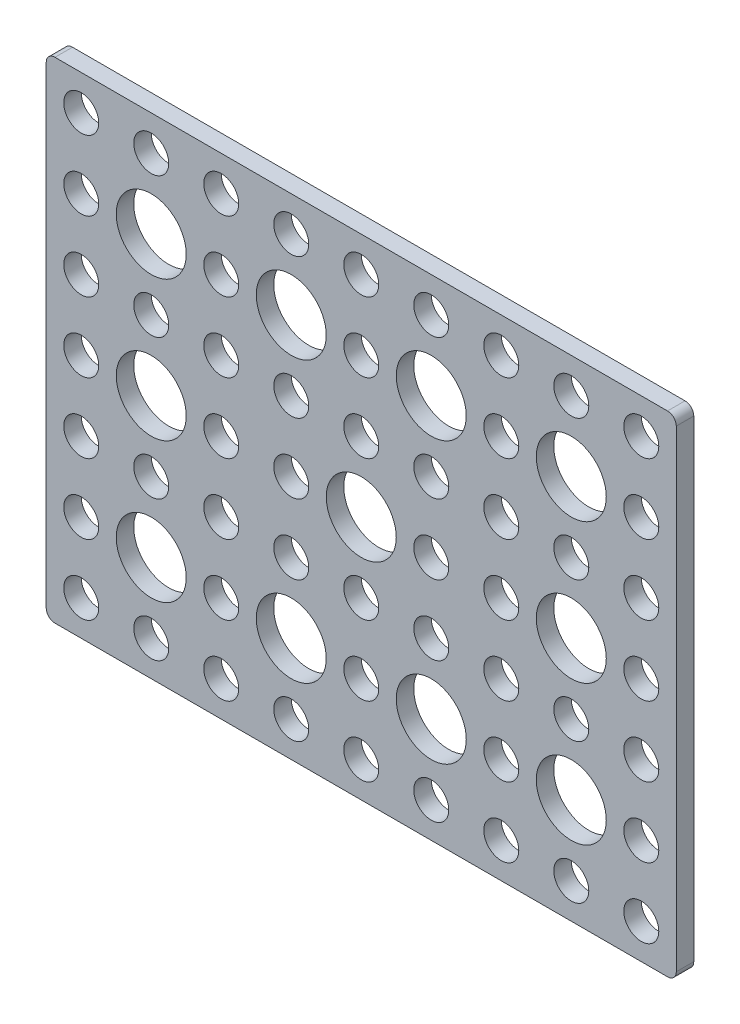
from build123d import *

# Parameters (mm, degrees)
SKETCH_1_W      = 72
SKETCH_1_H      = 56
SKETCH_1_R      = 2
SKETCH_1_R_2    = 4
EXTRUDE_1_DEPTH = 2
FILLET_1_R      = 1
FILLET_2_R      = 1
FILLET_3_R      = 1
FILLET_4_R      = 1


with BuildPart() as part:
    # Sketch 1 → Extrude 1 (new body)
    with BuildSketch(Plane.XY):
        with Locations((-36, 28)):
            Rectangle(SKETCH_1_W, SKETCH_1_H)
        with Locations((-4, 4)):
            Circle(SKETCH_1_R, mode=Mode.SUBTRACT)
        with Locations((-4, 12)):
            Circle(SKETCH_1_R, mode=Mode.SUBTRACT)
        with Locations((-4, 20)):
            Circle(SKETCH_1_R, mode=Mode.SUBTRACT)
        with Locations((-4, 28)):
            Circle(SKETCH_1_R, mode=Mode.SUBTRACT)
        with Locations((-4, 36)):
            Circle(SKETCH_1_R, mode=Mode.SUBTRACT)
        with Locations((-4, 44)):
            Circle(SKETCH_1_R, mode=Mode.SUBTRACT)
        with Locations((-4, 52)):
            Circle(SKETCH_1_R, mode=Mode.SUBTRACT)
        with Locations((-12, 4)):
            Circle(SKETCH_1_R, mode=Mode.SUBTRACT)
        with Locations((-12, 20)):
            Circle(SKETCH_1_R, mode=Mode.SUBTRACT)
        with Locations((-12, 36)):
            Circle(SKETCH_1_R, mode=Mode.SUBTRACT)
        with Locations((-12, 52)):
            Circle(SKETCH_1_R, mode=Mode.SUBTRACT)
        with Locations((-20, 4)):
            Circle(SKETCH_1_R, mode=Mode.SUBTRACT)
        with Locations((-20, 12)):
            Circle(SKETCH_1_R, mode=Mode.SUBTRACT)
        with Locations((-20, 20)):
            Circle(SKETCH_1_R, mode=Mode.SUBTRACT)
        with Locations((-20, 28)):
            Circle(SKETCH_1_R, mode=Mode.SUBTRACT)
        with Locations((-20, 36)):
            Circle(SKETCH_1_R, mode=Mode.SUBTRACT)
        with Locations((-20, 44)):
            Circle(SKETCH_1_R, mode=Mode.SUBTRACT)
        with Locations((-20, 52)):
            Circle(SKETCH_1_R, mode=Mode.SUBTRACT)
        with Locations((-28, 4)):
            Circle(SKETCH_1_R, mode=Mode.SUBTRACT)
        with Locations((-28, 20)):
            Circle(SKETCH_1_R, mode=Mode.SUBTRACT)
        with Locations((-28, 28)):
            Circle(SKETCH_1_R, mode=Mode.SUBTRACT)
        with Locations((-28, 36)):
            Circle(SKETCH_1_R, mode=Mode.SUBTRACT)
        with Locations((-28, 52)):
            Circle(SKETCH_1_R, mode=Mode.SUBTRACT)
        with Locations((-36, 4)):
            Circle(SKETCH_1_R, mode=Mode.SUBTRACT)
        with Locations((-36, 12)):
            Circle(SKETCH_1_R, mode=Mode.SUBTRACT)
        with Locations((-36, 20)):
            Circle(SKETCH_1_R, mode=Mode.SUBTRACT)
        with Locations((-36, 36)):
            Circle(SKETCH_1_R, mode=Mode.SUBTRACT)
        with Locations((-36, 44)):
            Circle(SKETCH_1_R, mode=Mode.SUBTRACT)
        with Locations((-36, 52)):
            Circle(SKETCH_1_R, mode=Mode.SUBTRACT)
        with Locations((-44, 4)):
            Circle(SKETCH_1_R, mode=Mode.SUBTRACT)
        with Locations((-44, 20)):
            Circle(SKETCH_1_R, mode=Mode.SUBTRACT)
        with Locations((-44, 28)):
            Circle(SKETCH_1_R, mode=Mode.SUBTRACT)
        with Locations((-44, 36)):
            Circle(SKETCH_1_R, mode=Mode.SUBTRACT)
        with Locations((-44, 52)):
            Circle(SKETCH_1_R, mode=Mode.SUBTRACT)
        with Locations((-52, 4)):
            Circle(SKETCH_1_R, mode=Mode.SUBTRACT)
        with Locations((-52, 12)):
            Circle(SKETCH_1_R, mode=Mode.SUBTRACT)
        with Locations((-52, 20)):
            Circle(SKETCH_1_R, mode=Mode.SUBTRACT)
        with Locations((-52, 28)):
            Circle(SKETCH_1_R, mode=Mode.SUBTRACT)
        with Locations((-52, 36)):
            Circle(SKETCH_1_R, mode=Mode.SUBTRACT)
        with Locations((-52, 44)):
            Circle(SKETCH_1_R, mode=Mode.SUBTRACT)
        with Locations((-52, 52)):
            Circle(SKETCH_1_R, mode=Mode.SUBTRACT)
        with Locations((-60, 4)):
            Circle(SKETCH_1_R, mode=Mode.SUBTRACT)
        with Locations((-60, 20)):
            Circle(SKETCH_1_R, mode=Mode.SUBTRACT)
        with Locations((-60, 36)):
            Circle(SKETCH_1_R, mode=Mode.SUBTRACT)
        with Locations((-60, 52)):
            Circle(SKETCH_1_R, mode=Mode.SUBTRACT)
        with Locations((-68, 4)):
            Circle(SKETCH_1_R, mode=Mode.SUBTRACT)
        with Locations((-68, 12)):
            Circle(SKETCH_1_R, mode=Mode.SUBTRACT)
        with Locations((-68, 20)):
            Circle(SKETCH_1_R, mode=Mode.SUBTRACT)
        with Locations((-68, 28)):
            Circle(SKETCH_1_R, mode=Mode.SUBTRACT)
        with Locations((-68, 36)):
            Circle(SKETCH_1_R, mode=Mode.SUBTRACT)
        with Locations((-68, 44)):
            Circle(SKETCH_1_R, mode=Mode.SUBTRACT)
        with Locations((-68, 52)):
            Circle(SKETCH_1_R, mode=Mode.SUBTRACT)
        with Locations((-60, 44)):
            Circle(SKETCH_1_R_2, mode=Mode.SUBTRACT)
        with Locations((-44, 44)):
            Circle(SKETCH_1_R_2, mode=Mode.SUBTRACT)
        with Locations((-28, 44)):
            Circle(SKETCH_1_R_2, mode=Mode.SUBTRACT)
        with Locations((-12, 44)):
            Circle(SKETCH_1_R_2, mode=Mode.SUBTRACT)
        with Locations((-60, 12)):
            Circle(SKETCH_1_R_2, mode=Mode.SUBTRACT)
        with Locations((-44, 12)):
            Circle(SKETCH_1_R_2, mode=Mode.SUBTRACT)
        with Locations((-28, 12)):
            Circle(SKETCH_1_R_2, mode=Mode.SUBTRACT)
        with Locations((-12, 12)):
            Circle(SKETCH_1_R_2, mode=Mode.SUBTRACT)
        with Locations((-60, 28)):
            Circle(SKETCH_1_R_2, mode=Mode.SUBTRACT)
        with Locations((-36, 28)):
            Circle(SKETCH_1_R_2, mode=Mode.SUBTRACT)
        with Locations((-12, 28)):
            Circle(SKETCH_1_R_2, mode=Mode.SUBTRACT)
    extrude(amount=EXTRUDE_1_DEPTH)

    # Fillet 1
    fillet_1_edges = [part.edges().sort_by_distance(p)[0] for p in [
        (0, 0, 1),
    ]]
    fillet(fillet_1_edges, radius=FILLET_1_R)

    # Fillet 2
    fillet_2_edges = [part.edges().sort_by_distance(p)[0] for p in [
        (0, 56, 1),
    ]]
    fillet(fillet_2_edges, radius=FILLET_2_R)

    # Fillet 3
    fillet_3_edges = [part.edges().sort_by_distance(p)[0] for p in [
        (-72, 56, 1),
    ]]
    fillet(fillet_3_edges, radius=FILLET_3_R)

    # Fillet 4
    fillet_4_edges = [part.edges().sort_by_distance(p)[0] for p in [
        (-72, 0, 1),
    ]]
    fillet(fillet_4_edges, radius=FILLET_4_R)


solid = part.part
